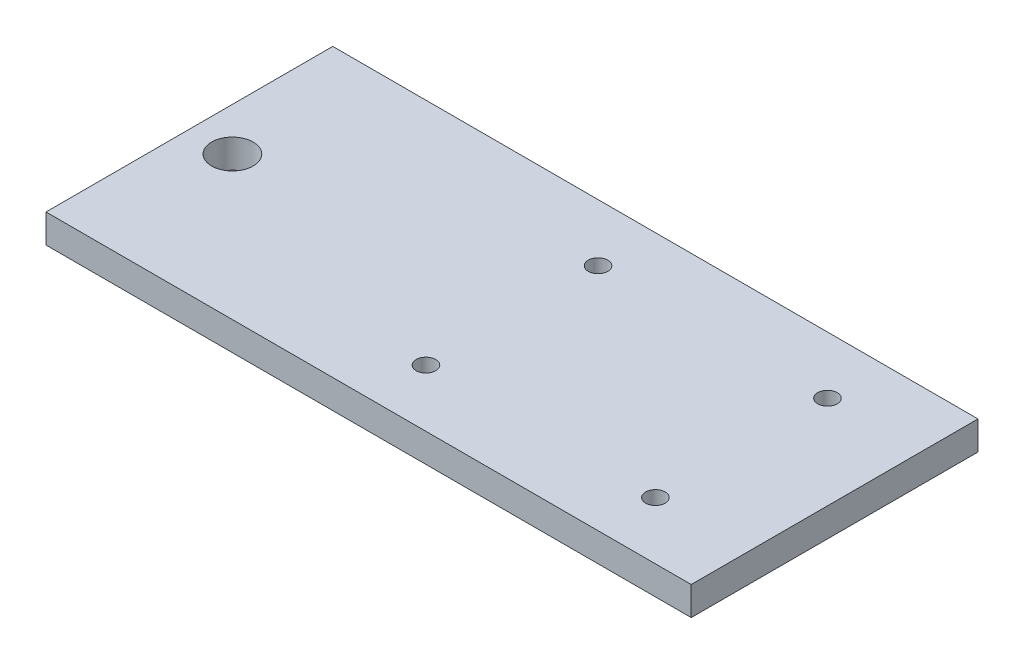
ISO-10303-21;
HEADER;
FILE_DESCRIPTION(('STEP AP214'),'2;1');
FILE_NAME('part.step','',(''),(''),'','','');
FILE_SCHEMA(('AUTOMOTIVE_DESIGN { 1 0 10303 214 1 1 1 1 }'));
ENDSEC;
DATA;
#1=APPLICATION_CONTEXT('core data for automotive mechanical design processes');
#2=APPLICATION_PROTOCOL_DEFINITION('international standard','automotive_design',2000,#1);
#3=PRODUCT_CONTEXT('',#1,'mechanical');
#4=PRODUCT('Part','Part','',(#3));
#5=PRODUCT_RELATED_PRODUCT_CATEGORY('part','',(#4));
#6=PRODUCT_DEFINITION_FORMATION('','',#4);
#7=PRODUCT_DEFINITION_CONTEXT('part definition',#1,'design');
#8=PRODUCT_DEFINITION('design','',#6,#7);
#9=PRODUCT_DEFINITION_SHAPE('','',#8);
#10=(LENGTH_UNIT() NAMED_UNIT(*) SI_UNIT(.MILLI.,.METRE.));
#11=(NAMED_UNIT(*) PLANE_ANGLE_UNIT() SI_UNIT($,.RADIAN.));
#12=(NAMED_UNIT(*) SI_UNIT($,.STERADIAN.) SOLID_ANGLE_UNIT());
#13=UNCERTAINTY_MEASURE_WITH_UNIT(LENGTH_MEASURE(1.E-05),#10,'distance_accuracy_value','');
#14=(GEOMETRIC_REPRESENTATION_CONTEXT(3) GLOBAL_UNCERTAINTY_ASSIGNED_CONTEXT((#13)) GLOBAL_UNIT_ASSIGNED_CONTEXT((#10,
#11,#12)) REPRESENTATION_CONTEXT('',''));
#15=CARTESIAN_POINT('',(0.,0.,0.));
#16=DIRECTION('',(0.,0.,1.));
#17=DIRECTION('',(1.,0.,0.));
#18=AXIS2_PLACEMENT_3D('',#15,#16,#17);
#19=CARTESIAN_POINT('',(112.5,0.,50.));
#20=DIRECTION('',(0.,-1.,0.));
#21=DIRECTION('',(0.,0.,-1.));
#22=AXIS2_PLACEMENT_3D('',#19,#20,#21);
#23=PLANE('',#22);
#24=CARTESIAN_POINT('',(0.,0.,-30.));
#25=DIRECTION('',(0.,1.,0.));
#26=DIRECTION('',(0.,0.,1.));
#27=AXIS2_PLACEMENT_3D('',#24,#25,#26);
#28=CIRCLE('',#27,3.39999999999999);
#29=CARTESIAN_POINT('',(0.,0.,-26.6));
#30=VERTEX_POINT('',#29);
#31=EDGE_CURVE('E202',#30,#30,#28,.T.);
#32=ORIENTED_EDGE('',*,*,#31,.F.);
#33=EDGE_LOOP('',(#32));
#34=FACE_BOUND('',#33,.T.);
#35=CARTESIAN_POINT('',(80.,0.,30.));
#36=DIRECTION('',(0.,1.,0.));
#37=DIRECTION('',(0.,0.,1.));
#38=AXIS2_PLACEMENT_3D('',#35,#36,#37);
#39=CIRCLE('',#38,3.39999999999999);
#40=CARTESIAN_POINT('',(80.,0.,33.4));
#41=VERTEX_POINT('',#40);
#42=EDGE_CURVE('E215',#41,#41,#39,.T.);
#43=ORIENTED_EDGE('',*,*,#42,.F.);
#44=EDGE_LOOP('',(#43));
#45=FACE_BOUND('',#44,.T.);
#46=CARTESIAN_POINT('',(-97.5,0.,0.));
#47=DIRECTION('',(0.,1.,0.));
#48=DIRECTION('',(0.,0.,1.));
#49=AXIS2_PLACEMENT_3D('',#46,#47,#48);
#50=CIRCLE('',#49,7.25000000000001);
#51=CARTESIAN_POINT('',(-97.5,0.,7.25000000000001));
#52=VERTEX_POINT('',#51);
#53=EDGE_CURVE('E102',#52,#52,#50,.T.);
#54=ORIENTED_EDGE('',*,*,#53,.F.);
#55=EDGE_LOOP('',(#54));
#56=FACE_BOUND('',#55,.T.);
#57=DIRECTION('',(0.,0.,1.));
#58=VECTOR('',#57,1.);
#59=CARTESIAN_POINT('',(-112.5,0.,50.));
#60=LINE('',#59,#58);
#61=CARTESIAN_POINT('',(-112.5,0.,-50.));
#62=VERTEX_POINT('',#61);
#63=CARTESIAN_POINT('',(-112.5,0.,50.));
#64=VERTEX_POINT('',#63);
#65=EDGE_CURVE('E108',#62,#64,#60,.T.);
#66=ORIENTED_EDGE('',*,*,#65,.T.);
#67=DIRECTION('',(-1.,0.,0.));
#68=VECTOR('',#67,1.);
#69=CARTESIAN_POINT('',(112.5,0.,50.));
#70=LINE('',#69,#68);
#71=CARTESIAN_POINT('',(112.5,0.,50.));
#72=VERTEX_POINT('',#71);
#73=EDGE_CURVE('E95',#72,#64,#70,.T.);
#74=ORIENTED_EDGE('',*,*,#73,.F.);
#75=DIRECTION('',(0.,0.,1.));
#76=VECTOR('',#75,1.);
#77=CARTESIAN_POINT('',(112.5,0.,50.));
#78=LINE('',#77,#76);
#79=CARTESIAN_POINT('',(112.5,0.,-50.));
#80=VERTEX_POINT('',#79);
#81=EDGE_CURVE('E52',#80,#72,#78,.T.);
#82=ORIENTED_EDGE('',*,*,#81,.F.);
#83=DIRECTION('',(-1.,0.,0.));
#84=VECTOR('',#83,1.);
#85=CARTESIAN_POINT('',(112.5,0.,-50.));
#86=LINE('',#85,#84);
#87=EDGE_CURVE('E121',#80,#62,#86,.T.);
#88=ORIENTED_EDGE('',*,*,#87,.T.);
#89=EDGE_LOOP('',(#66,#74,#82,#88));
#90=FACE_BOUND('',#89,.T.);
#91=CARTESIAN_POINT('',(80.,0.,-30.));
#92=DIRECTION('',(0.,1.,0.));
#93=DIRECTION('',(0.,0.,1.));
#94=AXIS2_PLACEMENT_3D('',#91,#92,#93);
#95=CIRCLE('',#94,3.39999999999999);
#96=CARTESIAN_POINT('',(80.,0.,-26.6));
#97=VERTEX_POINT('',#96);
#98=EDGE_CURVE('E209',#97,#97,#95,.T.);
#99=ORIENTED_EDGE('',*,*,#98,.F.);
#100=EDGE_LOOP('',(#99));
#101=FACE_BOUND('',#100,.T.);
#102=CARTESIAN_POINT('',(0.,0.,30.));
#103=DIRECTION('',(0.,1.,0.));
#104=DIRECTION('',(0.,0.,1.));
#105=AXIS2_PLACEMENT_3D('',#102,#103,#104);
#106=CIRCLE('',#105,3.39999999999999);
#107=CARTESIAN_POINT('',(0.,0.,33.4));
#108=VERTEX_POINT('',#107);
#109=EDGE_CURVE('E197',#108,#108,#106,.T.);
#110=ORIENTED_EDGE('',*,*,#109,.F.);
#111=EDGE_LOOP('',(#110));
#112=FACE_BOUND('',#111,.T.);
#113=ADVANCED_FACE('F36',(#34,#45,#56,#90,#101,#112),#23,.F.);
#114=CARTESIAN_POINT('',(112.5,0.,50.));
#115=DIRECTION('',(0.,0.,-1.));
#116=DIRECTION('',(-1.,0.,0.));
#117=AXIS2_PLACEMENT_3D('',#114,#115,#116);
#118=PLANE('',#117);
#119=DIRECTION('',(0.,-1.,0.));
#120=VECTOR('',#119,1.);
#121=CARTESIAN_POINT('',(-112.5,0.,50.));
#122=LINE('',#121,#120);
#123=CARTESIAN_POINT('',(-112.5,-10.,50.));
#124=VERTEX_POINT('',#123);
#125=EDGE_CURVE('E82',#64,#124,#122,.T.);
#126=ORIENTED_EDGE('',*,*,#125,.T.);
#127=DIRECTION('',(-1.,0.,0.));
#128=VECTOR('',#127,1.);
#129=CARTESIAN_POINT('',(112.5,-10.,50.));
#130=LINE('',#129,#128);
#131=CARTESIAN_POINT('',(112.5,-10.,50.));
#132=VERTEX_POINT('',#131);
#133=EDGE_CURVE('E11',#132,#124,#130,.T.);
#134=ORIENTED_EDGE('',*,*,#133,.F.);
#135=DIRECTION('',(0.,-1.,0.));
#136=VECTOR('',#135,1.);
#137=CARTESIAN_POINT('',(112.5,0.,50.));
#138=LINE('',#137,#136);
#139=EDGE_CURVE('E111',#72,#132,#138,.T.);
#140=ORIENTED_EDGE('',*,*,#139,.F.);
#141=ORIENTED_EDGE('',*,*,#73,.T.);
#142=EDGE_LOOP('',(#126,#134,#140,#141));
#143=FACE_BOUND('',#142,.T.);
#144=ADVANCED_FACE('F38',(#143),#118,.F.);
#145=CARTESIAN_POINT('',(112.5,-10.,50.));
#146=DIRECTION('',(0.,1.,0.));
#147=DIRECTION('',(0.,0.,1.));
#148=AXIS2_PLACEMENT_3D('',#145,#146,#147);
#149=PLANE('',#148);
#150=CARTESIAN_POINT('',(0.,-10.,30.));
#151=DIRECTION('',(0.,1.,0.));
#152=DIRECTION('',(0.,0.,1.));
#153=AXIS2_PLACEMENT_3D('',#150,#151,#152);
#154=CIRCLE('',#153,3.39999999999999);
#155=CARTESIAN_POINT('',(0.,-10.,33.4));
#156=VERTEX_POINT('',#155);
#157=EDGE_CURVE('E155',#156,#156,#154,.T.);
#158=ORIENTED_EDGE('',*,*,#157,.T.);
#159=EDGE_LOOP('',(#158));
#160=FACE_BOUND('',#159,.T.);
#161=CARTESIAN_POINT('',(0.,-9.99999999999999,-30.));
#162=DIRECTION('',(0.,1.,0.));
#163=DIRECTION('',(0.,0.,1.));
#164=AXIS2_PLACEMENT_3D('',#161,#162,#163);
#165=CIRCLE('',#164,3.39999999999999);
#166=CARTESIAN_POINT('',(0.,-9.99999999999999,-26.6));
#167=VERTEX_POINT('',#166);
#168=EDGE_CURVE('E159',#167,#167,#165,.T.);
#169=ORIENTED_EDGE('',*,*,#168,.T.);
#170=EDGE_LOOP('',(#169));
#171=FACE_BOUND('',#170,.T.);
#172=CARTESIAN_POINT('',(80.,-9.99999999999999,-30.));
#173=DIRECTION('',(0.,1.,0.));
#174=DIRECTION('',(0.,0.,1.));
#175=AXIS2_PLACEMENT_3D('',#172,#173,#174);
#176=CIRCLE('',#175,3.39999999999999);
#177=CARTESIAN_POINT('',(80.,-9.99999999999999,-26.6));
#178=VERTEX_POINT('',#177);
#179=EDGE_CURVE('E163',#178,#178,#176,.T.);
#180=ORIENTED_EDGE('',*,*,#179,.T.);
#181=EDGE_LOOP('',(#180));
#182=FACE_BOUND('',#181,.T.);
#183=CARTESIAN_POINT('',(80.,-10.,30.));
#184=DIRECTION('',(0.,1.,0.));
#185=DIRECTION('',(0.,0.,1.));
#186=AXIS2_PLACEMENT_3D('',#183,#184,#185);
#187=CIRCLE('',#186,3.39999999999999);
#188=CARTESIAN_POINT('',(80.,-10.,33.4));
#189=VERTEX_POINT('',#188);
#190=EDGE_CURVE('E167',#189,#189,#187,.T.);
#191=ORIENTED_EDGE('',*,*,#190,.T.);
#192=EDGE_LOOP('',(#191));
#193=FACE_BOUND('',#192,.T.);
#194=CARTESIAN_POINT('',(-97.5,-10.,0.));
#195=DIRECTION('',(0.,1.,0.));
#196=DIRECTION('',(0.,0.,1.));
#197=AXIS2_PLACEMENT_3D('',#194,#195,#196);
#198=CIRCLE('',#197,7.25000000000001);
#199=CARTESIAN_POINT('',(-97.5,-10.,7.25000000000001));
#200=VERTEX_POINT('',#199);
#201=EDGE_CURVE('E97',#200,#200,#198,.T.);
#202=ORIENTED_EDGE('',*,*,#201,.T.);
#203=EDGE_LOOP('',(#202));
#204=FACE_BOUND('',#203,.T.);
#205=DIRECTION('',(0.,0.,-1.));
#206=VECTOR('',#205,1.);
#207=CARTESIAN_POINT('',(-112.5,-10.,50.));
#208=LINE('',#207,#206);
#209=CARTESIAN_POINT('',(-112.5,-9.99999999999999,-50.));
#210=VERTEX_POINT('',#209);
#211=EDGE_CURVE('E78',#124,#210,#208,.T.);
#212=ORIENTED_EDGE('',*,*,#211,.T.);
#213=DIRECTION('',(-1.,0.,0.));
#214=VECTOR('',#213,1.);
#215=CARTESIAN_POINT('',(112.5,-9.99999999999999,-50.));
#216=LINE('',#215,#214);
#217=CARTESIAN_POINT('',(112.5,-9.99999999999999,-50.));
#218=VERTEX_POINT('',#217);
#219=EDGE_CURVE('E45',#218,#210,#216,.T.);
#220=ORIENTED_EDGE('',*,*,#219,.F.);
#221=DIRECTION('',(0.,0.,-1.));
#222=VECTOR('',#221,1.);
#223=CARTESIAN_POINT('',(112.5,-10.,50.));
#224=LINE('',#223,#222);
#225=EDGE_CURVE('E91',#132,#218,#224,.T.);
#226=ORIENTED_EDGE('',*,*,#225,.F.);
#227=ORIENTED_EDGE('',*,*,#133,.T.);
#228=EDGE_LOOP('',(#212,#220,#226,#227));
#229=FACE_BOUND('',#228,.T.);
#230=ADVANCED_FACE('F90',(#160,#171,#182,#193,#204,#229),#149,.F.);
#231=CARTESIAN_POINT('',(112.5,0.,-50.));
#232=DIRECTION('',(0.,0.,1.));
#233=DIRECTION('',(1.,0.,0.));
#234=AXIS2_PLACEMENT_3D('',#231,#232,#233);
#235=PLANE('',#234);
#236=DIRECTION('',(0.,1.,0.));
#237=VECTOR('',#236,1.);
#238=CARTESIAN_POINT('',(-112.5,0.,-50.));
#239=LINE('',#238,#237);
#240=EDGE_CURVE('E83',#210,#62,#239,.T.);
#241=ORIENTED_EDGE('',*,*,#240,.T.);
#242=ORIENTED_EDGE('',*,*,#87,.F.);
#243=DIRECTION('',(0.,1.,0.));
#244=VECTOR('',#243,1.);
#245=CARTESIAN_POINT('',(112.5,0.,-50.));
#246=LINE('',#245,#244);
#247=EDGE_CURVE('E57',#218,#80,#246,.T.);
#248=ORIENTED_EDGE('',*,*,#247,.F.);
#249=ORIENTED_EDGE('',*,*,#219,.T.);
#250=EDGE_LOOP('',(#241,#242,#248,#249));
#251=FACE_BOUND('',#250,.T.);
#252=ADVANCED_FACE('F127',(#251),#235,.F.);
#253=CARTESIAN_POINT('',(112.5,0.,50.));
#254=DIRECTION('',(1.,0.,0.));
#255=DIRECTION('',(0.,0.,-1.));
#256=AXIS2_PLACEMENT_3D('',#253,#254,#255);
#257=PLANE('',#256);
#258=ORIENTED_EDGE('',*,*,#139,.T.);
#259=ORIENTED_EDGE('',*,*,#225,.T.);
#260=ORIENTED_EDGE('',*,*,#247,.T.);
#261=ORIENTED_EDGE('',*,*,#81,.T.);
#262=EDGE_LOOP('',(#258,#259,#260,#261));
#263=FACE_BOUND('',#262,.T.);
#264=ADVANCED_FACE('F130',(#263),#257,.T.);
#265=CARTESIAN_POINT('',(-112.5,0.,50.));
#266=DIRECTION('',(1.,0.,0.));
#267=DIRECTION('',(0.,0.,-1.));
#268=AXIS2_PLACEMENT_3D('',#265,#266,#267);
#269=PLANE('',#268);
#270=ORIENTED_EDGE('',*,*,#125,.F.);
#271=ORIENTED_EDGE('',*,*,#65,.F.);
#272=ORIENTED_EDGE('',*,*,#240,.F.);
#273=ORIENTED_EDGE('',*,*,#211,.F.);
#274=EDGE_LOOP('',(#270,#271,#272,#273));
#275=FACE_BOUND('',#274,.T.);
#276=ADVANCED_FACE('F79',(#275),#269,.F.);
#277=CARTESIAN_POINT('',(-97.5,-210.,0.));
#278=DIRECTION('',(0.,1.,0.));
#279=DIRECTION('',(0.,0.,1.));
#280=AXIS2_PLACEMENT_3D('',#277,#278,#279);
#281=CYLINDRICAL_SURFACE('',#280,7.25000000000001);
#282=ORIENTED_EDGE('',*,*,#53,.T.);
#283=EDGE_LOOP('',(#282));
#284=FACE_BOUND('',#283,.T.);
#285=ORIENTED_EDGE('',*,*,#201,.F.);
#286=EDGE_LOOP('',(#285));
#287=FACE_BOUND('',#286,.T.);
#288=ADVANCED_FACE('F137',(#284,#287),#281,.F.);
#289=CARTESIAN_POINT('',(80.,0.,30.));
#290=DIRECTION('',(0.,1.,0.));
#291=DIRECTION('',(0.,0.,1.));
#292=AXIS2_PLACEMENT_3D('',#289,#290,#291);
#293=CYLINDRICAL_SURFACE('',#292,3.39999999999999);
#294=ORIENTED_EDGE('',*,*,#190,.F.);
#295=EDGE_LOOP('',(#294));
#296=FACE_BOUND('',#295,.T.);
#297=ORIENTED_EDGE('',*,*,#42,.T.);
#298=EDGE_LOOP('',(#297));
#299=FACE_BOUND('',#298,.T.);
#300=ADVANCED_FACE('F171',(#296,#299),#293,.F.);
#301=CARTESIAN_POINT('',(80.,0.,-30.));
#302=DIRECTION('',(0.,1.,0.));
#303=DIRECTION('',(0.,0.,1.));
#304=AXIS2_PLACEMENT_3D('',#301,#302,#303);
#305=CYLINDRICAL_SURFACE('',#304,3.39999999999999);
#306=ORIENTED_EDGE('',*,*,#179,.F.);
#307=EDGE_LOOP('',(#306));
#308=FACE_BOUND('',#307,.T.);
#309=ORIENTED_EDGE('',*,*,#98,.T.);
#310=EDGE_LOOP('',(#309));
#311=FACE_BOUND('',#310,.T.);
#312=ADVANCED_FACE('F177',(#308,#311),#305,.F.);
#313=CARTESIAN_POINT('',(0.,0.,-30.));
#314=DIRECTION('',(0.,1.,0.));
#315=DIRECTION('',(0.,0.,1.));
#316=AXIS2_PLACEMENT_3D('',#313,#314,#315);
#317=CYLINDRICAL_SURFACE('',#316,3.39999999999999);
#318=ORIENTED_EDGE('',*,*,#168,.F.);
#319=EDGE_LOOP('',(#318));
#320=FACE_BOUND('',#319,.T.);
#321=ORIENTED_EDGE('',*,*,#31,.T.);
#322=EDGE_LOOP('',(#321));
#323=FACE_BOUND('',#322,.T.);
#324=ADVANCED_FACE('F184',(#320,#323),#317,.F.);
#325=CARTESIAN_POINT('',(0.,0.,30.));
#326=DIRECTION('',(0.,1.,0.));
#327=DIRECTION('',(0.,0.,1.));
#328=AXIS2_PLACEMENT_3D('',#325,#326,#327);
#329=CYLINDRICAL_SURFACE('',#328,3.39999999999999);
#330=ORIENTED_EDGE('',*,*,#157,.F.);
#331=EDGE_LOOP('',(#330));
#332=FACE_BOUND('',#331,.T.);
#333=ORIENTED_EDGE('',*,*,#109,.T.);
#334=EDGE_LOOP('',(#333));
#335=FACE_BOUND('',#334,.T.);
#336=ADVANCED_FACE('F188',(#332,#335),#329,.F.);
#337=CLOSED_SHELL('',(#113,#144,#230,#252,#264,#276,#288,#300,#312,#324,#336));
#338=MANIFOLD_SOLID_BREP('B2',#337);
#339=ADVANCED_BREP_SHAPE_REPRESENTATION('',(#18,#338),#14);
#340=SHAPE_DEFINITION_REPRESENTATION(#9,#339);
ENDSEC;
END-ISO-10303-21;
